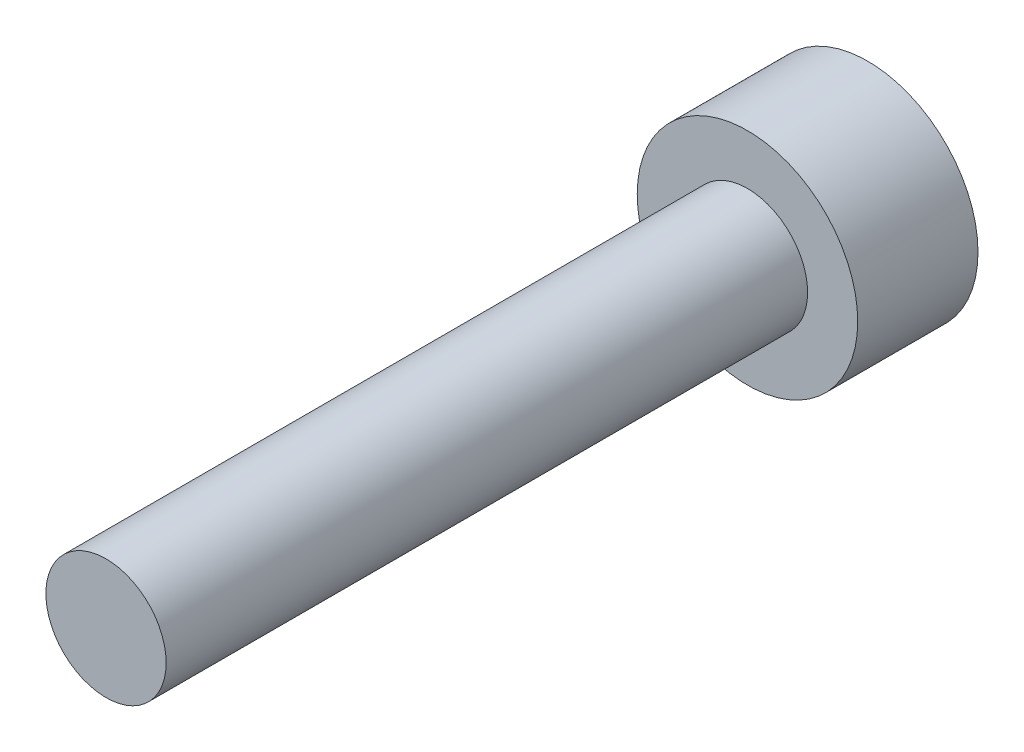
from build123d import *

# Parameters (mm, degrees)
SOCKET_HEAD_START   = -3
SKETCH_1_R          = 2.75
SOCKET_HEAD_DEPTH   = 3
SKETCH_2_R          = 1.5
NOMINAL_SHANK_DEPTH = 16


with BuildPart() as part:
    # Sketch 1 → Socket_head (new body)
    with BuildSketch(Plane.XY.offset(SOCKET_HEAD_START)):
        Circle(SKETCH_1_R)
    extrude(amount=SOCKET_HEAD_DEPTH)

    # Sketch 2 → Nominal_shank (add)
    with BuildSketch(Plane.XY):
        Circle(SKETCH_2_R)
    extrude(amount=NOMINAL_SHANK_DEPTH)


solid = part.part
